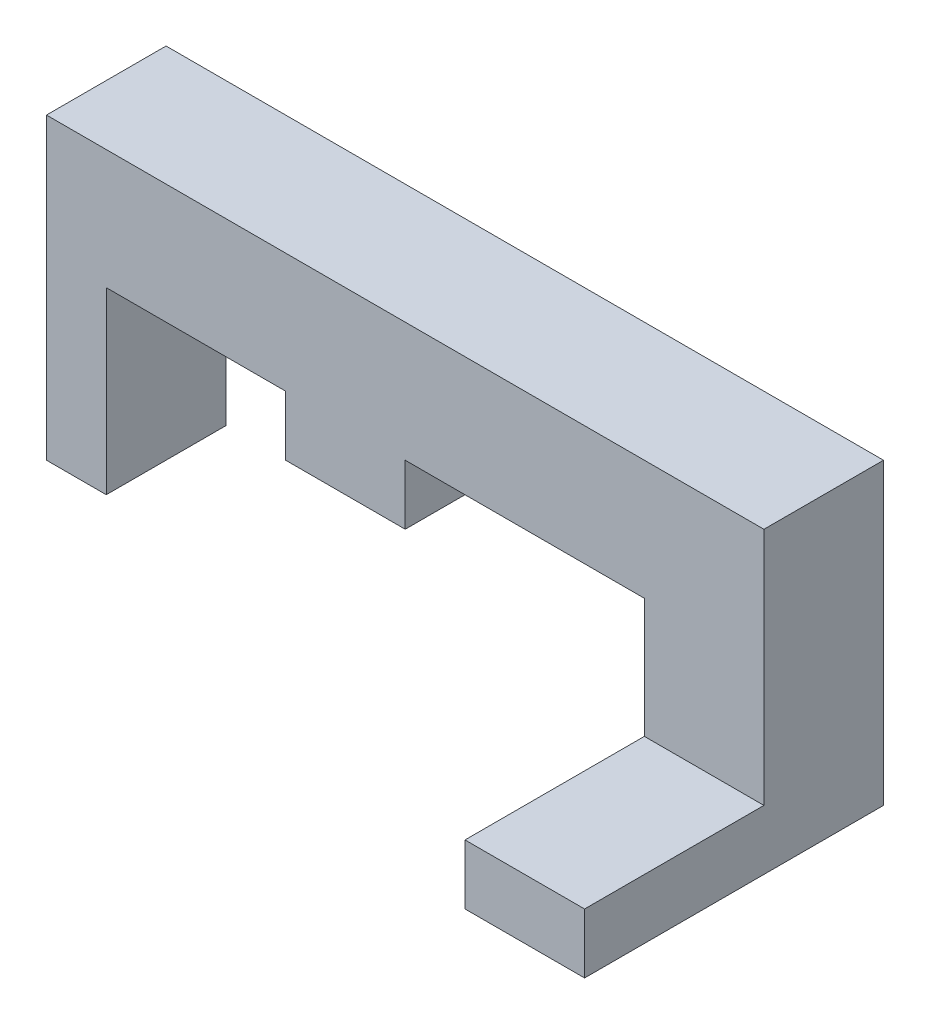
ISO-10303-21;
HEADER;
FILE_DESCRIPTION(('STEP AP214'),'2;1');
FILE_NAME('part.step','',(''),(''),'','','');
FILE_SCHEMA(('AUTOMOTIVE_DESIGN { 1 0 10303 214 1 1 1 1 }'));
ENDSEC;
DATA;
#1=APPLICATION_CONTEXT('core data for automotive mechanical design processes');
#2=APPLICATION_PROTOCOL_DEFINITION('international standard','automotive_design',2000,#1);
#3=PRODUCT_CONTEXT('',#1,'mechanical');
#4=PRODUCT('Part','Part','',(#3));
#5=PRODUCT_RELATED_PRODUCT_CATEGORY('part','',(#4));
#6=PRODUCT_DEFINITION_FORMATION('','',#4);
#7=PRODUCT_DEFINITION_CONTEXT('part definition',#1,'design');
#8=PRODUCT_DEFINITION('design','',#6,#7);
#9=PRODUCT_DEFINITION_SHAPE('','',#8);
#10=(LENGTH_UNIT() NAMED_UNIT(*) SI_UNIT(.MILLI.,.METRE.));
#11=(NAMED_UNIT(*) PLANE_ANGLE_UNIT() SI_UNIT($,.RADIAN.));
#12=(NAMED_UNIT(*) SI_UNIT($,.STERADIAN.) SOLID_ANGLE_UNIT());
#13=UNCERTAINTY_MEASURE_WITH_UNIT(LENGTH_MEASURE(1.E-05),#10,'distance_accuracy_value','');
#14=(GEOMETRIC_REPRESENTATION_CONTEXT(3) GLOBAL_UNCERTAINTY_ASSIGNED_CONTEXT((#13)) GLOBAL_UNIT_ASSIGNED_CONTEXT((#10,
#11,#12)) REPRESENTATION_CONTEXT('',''));
#15=CARTESIAN_POINT('',(0.,0.,0.));
#16=DIRECTION('',(0.,0.,1.));
#17=DIRECTION('',(1.,0.,0.));
#18=AXIS2_PLACEMENT_3D('',#15,#16,#17);
#19=CARTESIAN_POINT('',(-60.,-25.,25.));
#20=DIRECTION('',(0.,1.,0.));
#21=DIRECTION('',(0.,0.,1.));
#22=AXIS2_PLACEMENT_3D('',#19,#20,#21);
#23=PLANE('',#22);
#24=DIRECTION('',(1.,0.,0.));
#25=VECTOR('',#24,1.);
#26=CARTESIAN_POINT('',(-60.,-25.,25.));
#27=LINE('',#26,#25);
#28=CARTESIAN_POINT('',(40.,-25.,25.));
#29=VERTEX_POINT('',#28);
#30=CARTESIAN_POINT('',(60.,-25.,25.));
#31=VERTEX_POINT('',#30);
#32=EDGE_CURVE('E57',#29,#31,#27,.T.);
#33=ORIENTED_EDGE('',*,*,#32,.F.);
#34=DIRECTION('',(0.,0.,-1.));
#35=VECTOR('',#34,1.);
#36=CARTESIAN_POINT('',(40.,-25.,25.));
#37=LINE('',#36,#35);
#38=CARTESIAN_POINT('',(40.,-25.,-25.));
#39=VERTEX_POINT('',#38);
#40=EDGE_CURVE('E174',#29,#39,#37,.T.);
#41=ORIENTED_EDGE('',*,*,#40,.T.);
#42=DIRECTION('',(1.,0.,0.));
#43=VECTOR('',#42,1.);
#44=CARTESIAN_POINT('',(-60.,-25.,-25.));
#45=LINE('',#44,#43);
#46=CARTESIAN_POINT('',(60.,-25.,-25.));
#47=VERTEX_POINT('',#46);
#48=EDGE_CURVE('E193',#39,#47,#45,.T.);
#49=ORIENTED_EDGE('',*,*,#48,.T.);
#50=DIRECTION('',(0.,0.,-1.));
#51=VECTOR('',#50,1.);
#52=CARTESIAN_POINT('',(60.,-25.,25.));
#53=LINE('',#52,#51);
#54=EDGE_CURVE('E88',#31,#47,#53,.T.);
#55=ORIENTED_EDGE('',*,*,#54,.F.);
#56=EDGE_LOOP('',(#33,#41,#49,#55));
#57=FACE_BOUND('',#56,.T.);
#58=ADVANCED_FACE('F33',(#57),#23,.F.);
#59=CARTESIAN_POINT('',(0.,0.,25.));
#60=DIRECTION('',(0.,0.,1.));
#61=DIRECTION('',(1.,0.,0.));
#62=AXIS2_PLACEMENT_3D('',#59,#60,#61);
#63=PLANE('',#62);
#64=DIRECTION('',(0.,-1.,0.));
#65=VECTOR('',#64,1.);
#66=CARTESIAN_POINT('',(40.,4.99999999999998,25.));
#67=LINE('',#66,#65);
#68=CARTESIAN_POINT('',(40.,-15.,25.));
#69=VERTEX_POINT('',#68);
#70=EDGE_CURVE('E171',#69,#29,#67,.T.);
#71=ORIENTED_EDGE('',*,*,#70,.T.);
#72=ORIENTED_EDGE('',*,*,#32,.T.);
#73=DIRECTION('',(0.,1.,0.));
#74=VECTOR('',#73,1.);
#75=CARTESIAN_POINT('',(60.,25.,25.));
#76=LINE('',#75,#74);
#77=CARTESIAN_POINT('',(60.,-15.,25.));
#78=VERTEX_POINT('',#77);
#79=EDGE_CURVE('E105',#31,#78,#76,.T.);
#80=ORIENTED_EDGE('',*,*,#79,.T.);
#81=DIRECTION('',(1.,0.,0.));
#82=VECTOR('',#81,1.);
#83=CARTESIAN_POINT('',(-60.,-15.,25.));
#84=LINE('',#83,#82);
#85=EDGE_CURVE('E180',#69,#78,#84,.T.);
#86=ORIENTED_EDGE('',*,*,#85,.F.);
#87=EDGE_LOOP('',(#71,#72,#80,#86));
#88=FACE_BOUND('',#87,.T.);
#89=ADVANCED_FACE('F238',(#88),#63,.T.);
#90=CARTESIAN_POINT('',(-60.,-15.,25.));
#91=DIRECTION('',(0.,-1.,0.));
#92=DIRECTION('',(1.,0.,0.));
#93=AXIS2_PLACEMENT_3D('',#90,#91,#92);
#94=PLANE('',#93);
#95=DIRECTION('',(1.,0.,0.));
#96=VECTOR('',#95,1.);
#97=CARTESIAN_POINT('',(-60.,-15.,-5.));
#98=LINE('',#97,#96);
#99=CARTESIAN_POINT('',(40.,-15.,-5.));
#100=VERTEX_POINT('',#99);
#101=CARTESIAN_POINT('',(60.,-15.,-5.));
#102=VERTEX_POINT('',#101);
#103=EDGE_CURVE('E187',#100,#102,#98,.T.);
#104=ORIENTED_EDGE('',*,*,#103,.F.);
#105=DIRECTION('',(0.,0.,1.));
#106=VECTOR('',#105,1.);
#107=CARTESIAN_POINT('',(40.,-15.,25.));
#108=LINE('',#107,#106);
#109=EDGE_CURVE('E113',#100,#69,#108,.T.);
#110=ORIENTED_EDGE('',*,*,#109,.T.);
#111=ORIENTED_EDGE('',*,*,#85,.T.);
#112=DIRECTION('',(0.,0.,-1.));
#113=VECTOR('',#112,1.);
#114=CARTESIAN_POINT('',(60.,-15.,25.));
#115=LINE('',#114,#113);
#116=EDGE_CURVE('E176',#78,#102,#115,.T.);
#117=ORIENTED_EDGE('',*,*,#116,.T.);
#118=EDGE_LOOP('',(#104,#110,#111,#117));
#119=FACE_BOUND('',#118,.T.);
#120=ADVANCED_FACE('F239',(#119),#94,.F.);
#121=CARTESIAN_POINT('',(-60.,25.,25.));
#122=DIRECTION('',(1.,0.,0.));
#123=DIRECTION('',(0.,1.,0.));
#124=AXIS2_PLACEMENT_3D('',#121,#122,#123);
#125=PLANE('',#124);
#126=DIRECTION('',(0.,0.,-1.));
#127=VECTOR('',#126,1.);
#128=CARTESIAN_POINT('',(-60.,-25.,25.));
#129=LINE('',#128,#127);
#130=CARTESIAN_POINT('',(-60.,-25.,-5.));
#131=VERTEX_POINT('',#130);
#132=CARTESIAN_POINT('',(-60.,-25.,-25.));
#133=VERTEX_POINT('',#132);
#134=EDGE_CURVE('E111',#131,#133,#129,.T.);
#135=ORIENTED_EDGE('',*,*,#134,.F.);
#136=DIRECTION('',(0.,1.,0.));
#137=VECTOR('',#136,1.);
#138=CARTESIAN_POINT('',(-60.,25.,-5.));
#139=LINE('',#138,#137);
#140=CARTESIAN_POINT('',(-60.,25.,-5.));
#141=VERTEX_POINT('',#140);
#142=EDGE_CURVE('E177',#131,#141,#139,.T.);
#143=ORIENTED_EDGE('',*,*,#142,.T.);
#144=DIRECTION('',(0.,0.,-1.));
#145=VECTOR('',#144,1.);
#146=CARTESIAN_POINT('',(-60.,25.,25.));
#147=LINE('',#146,#145);
#148=CARTESIAN_POINT('',(-60.,25.,-25.));
#149=VERTEX_POINT('',#148);
#150=EDGE_CURVE('E89',#141,#149,#147,.T.);
#151=ORIENTED_EDGE('',*,*,#150,.T.);
#152=DIRECTION('',(0.,-1.,0.));
#153=VECTOR('',#152,1.);
#154=CARTESIAN_POINT('',(-60.,25.,-25.));
#155=LINE('',#154,#153);
#156=EDGE_CURVE('E103',#149,#133,#155,.T.);
#157=ORIENTED_EDGE('',*,*,#156,.T.);
#158=EDGE_LOOP('',(#135,#143,#151,#157));
#159=FACE_BOUND('',#158,.T.);
#160=ADVANCED_FACE('F35',(#159),#125,.F.);
#161=DIRECTION('',(0.,0.,-1.));
#162=VECTOR('',#161,1.);
#163=CARTESIAN_POINT('',(-50.,-25.,25.));
#164=LINE('',#163,#162);
#165=CARTESIAN_POINT('',(-50.,-25.,-5.));
#166=VERTEX_POINT('',#165);
#167=CARTESIAN_POINT('',(-50.,-25.,-25.));
#168=VERTEX_POINT('',#167);
#169=EDGE_CURVE('E169',#166,#168,#164,.T.);
#170=ORIENTED_EDGE('',*,*,#169,.F.);
#171=DIRECTION('',(-1.,0.,0.));
#172=VECTOR('',#171,1.);
#173=CARTESIAN_POINT('',(-50.,-25.,-5.));
#174=LINE('',#173,#172);
#175=EDGE_CURVE('E247',#166,#131,#174,.T.);
#176=ORIENTED_EDGE('',*,*,#175,.T.);
#177=ORIENTED_EDGE('',*,*,#134,.T.);
#178=EDGE_CURVE('E98',#133,#168,#45,.T.);
#179=ORIENTED_EDGE('',*,*,#178,.T.);
#180=EDGE_LOOP('',(#170,#176,#177,#179));
#181=FACE_BOUND('',#180,.T.);
#182=ADVANCED_FACE('F277',(#181),#23,.F.);
#183=CARTESIAN_POINT('',(60.,25.,25.));
#184=DIRECTION('',(-1.,0.,0.));
#185=DIRECTION('',(0.,-1.,0.));
#186=AXIS2_PLACEMENT_3D('',#183,#184,#185);
#187=PLANE('',#186);
#188=DIRECTION('',(0.,0.,-1.));
#189=VECTOR('',#188,1.);
#190=CARTESIAN_POINT('',(60.,25.,25.));
#191=LINE('',#190,#189);
#192=CARTESIAN_POINT('',(60.,25.,-5.));
#193=VERTEX_POINT('',#192);
#194=CARTESIAN_POINT('',(60.,25.,-25.));
#195=VERTEX_POINT('',#194);
#196=EDGE_CURVE('E77',#193,#195,#191,.T.);
#197=ORIENTED_EDGE('',*,*,#196,.F.);
#198=DIRECTION('',(0.,1.,0.));
#199=VECTOR('',#198,1.);
#200=CARTESIAN_POINT('',(60.,25.,-5.));
#201=LINE('',#200,#199);
#202=EDGE_CURVE('E181',#102,#193,#201,.T.);
#203=ORIENTED_EDGE('',*,*,#202,.F.);
#204=ORIENTED_EDGE('',*,*,#116,.F.);
#205=ORIENTED_EDGE('',*,*,#79,.F.);
#206=ORIENTED_EDGE('',*,*,#54,.T.);
#207=DIRECTION('',(0.,1.,0.));
#208=VECTOR('',#207,1.);
#209=CARTESIAN_POINT('',(60.,25.,-25.));
#210=LINE('',#209,#208);
#211=EDGE_CURVE('E93',#47,#195,#210,.T.);
#212=ORIENTED_EDGE('',*,*,#211,.T.);
#213=EDGE_LOOP('',(#197,#203,#204,#205,#206,#212));
#214=FACE_BOUND('',#213,.T.);
#215=ADVANCED_FACE('F94',(#214),#187,.F.);
#216=CARTESIAN_POINT('',(-60.,25.,25.));
#217=DIRECTION('',(0.,-1.,0.));
#218=DIRECTION('',(0.,0.,-1.));
#219=AXIS2_PLACEMENT_3D('',#216,#217,#218);
#220=PLANE('',#219);
#221=ORIENTED_EDGE('',*,*,#150,.F.);
#222=DIRECTION('',(1.,0.,0.));
#223=VECTOR('',#222,1.);
#224=CARTESIAN_POINT('',(-60.,25.,-5.));
#225=LINE('',#224,#223);
#226=EDGE_CURVE('E85',#141,#193,#225,.T.);
#227=ORIENTED_EDGE('',*,*,#226,.T.);
#228=ORIENTED_EDGE('',*,*,#196,.T.);
#229=DIRECTION('',(-1.,0.,0.));
#230=VECTOR('',#229,1.);
#231=CARTESIAN_POINT('',(-60.,25.,-25.));
#232=LINE('',#231,#230);
#233=EDGE_CURVE('E82',#195,#149,#232,.T.);
#234=ORIENTED_EDGE('',*,*,#233,.T.);
#235=EDGE_LOOP('',(#221,#227,#228,#234));
#236=FACE_BOUND('',#235,.T.);
#237=ADVANCED_FACE('F80',(#236),#220,.F.);
#238=CARTESIAN_POINT('',(0.,0.,-25.));
#239=DIRECTION('',(0.,0.,1.));
#240=DIRECTION('',(1.,0.,0.));
#241=AXIS2_PLACEMENT_3D('',#238,#239,#240);
#242=PLANE('',#241);
#243=ORIENTED_EDGE('',*,*,#48,.F.);
#244=DIRECTION('',(0.,-1.,0.));
#245=VECTOR('',#244,1.);
#246=CARTESIAN_POINT('',(40.,4.99999999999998,-25.));
#247=LINE('',#246,#245);
#248=CARTESIAN_POINT('',(40.,4.99999999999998,-25.));
#249=VERTEX_POINT('',#248);
#250=EDGE_CURVE('E206',#249,#39,#247,.T.);
#251=ORIENTED_EDGE('',*,*,#250,.F.);
#252=DIRECTION('',(1.,0.,0.));
#253=VECTOR('',#252,1.);
#254=CARTESIAN_POINT('',(0.,4.99999999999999,-25.));
#255=LINE('',#254,#253);
#256=CARTESIAN_POINT('',(0.,4.99999999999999,-25.));
#257=VERTEX_POINT('',#256);
#258=EDGE_CURVE('E243',#257,#249,#255,.T.);
#259=ORIENTED_EDGE('',*,*,#258,.F.);
#260=DIRECTION('',(0.,1.,0.));
#261=VECTOR('',#260,1.);
#262=CARTESIAN_POINT('',(0.,-5.00000000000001,-25.));
#263=LINE('',#262,#261);
#264=CARTESIAN_POINT('',(0.,-5.00000000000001,-25.));
#265=VERTEX_POINT('',#264);
#266=EDGE_CURVE('E258',#265,#257,#263,.T.);
#267=ORIENTED_EDGE('',*,*,#266,.F.);
#268=DIRECTION('',(1.,0.,0.));
#269=VECTOR('',#268,1.);
#270=CARTESIAN_POINT('',(-20.,-5.00000000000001,-25.));
#271=LINE('',#270,#269);
#272=CARTESIAN_POINT('',(-20.,-5.00000000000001,-25.));
#273=VERTEX_POINT('',#272);
#274=EDGE_CURVE('E154',#273,#265,#271,.T.);
#275=ORIENTED_EDGE('',*,*,#274,.F.);
#276=DIRECTION('',(0.,-1.,0.));
#277=VECTOR('',#276,1.);
#278=CARTESIAN_POINT('',(-20.,4.99999999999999,-25.));
#279=LINE('',#278,#277);
#280=CARTESIAN_POINT('',(-20.,4.99999999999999,-25.));
#281=VERTEX_POINT('',#280);
#282=EDGE_CURVE('E254',#281,#273,#279,.T.);
#283=ORIENTED_EDGE('',*,*,#282,.F.);
#284=DIRECTION('',(1.,0.,0.));
#285=VECTOR('',#284,1.);
#286=CARTESIAN_POINT('',(-50.,4.99999999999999,-25.));
#287=LINE('',#286,#285);
#288=CARTESIAN_POINT('',(-50.,4.99999999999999,-25.));
#289=VERTEX_POINT('',#288);
#290=EDGE_CURVE('E251',#289,#281,#287,.T.);
#291=ORIENTED_EDGE('',*,*,#290,.F.);
#292=DIRECTION('',(0.,1.,0.));
#293=VECTOR('',#292,1.);
#294=CARTESIAN_POINT('',(-50.,-25.,-25.));
#295=LINE('',#294,#293);
#296=EDGE_CURVE('E248',#168,#289,#295,.T.);
#297=ORIENTED_EDGE('',*,*,#296,.F.);
#298=ORIENTED_EDGE('',*,*,#178,.F.);
#299=ORIENTED_EDGE('',*,*,#156,.F.);
#300=ORIENTED_EDGE('',*,*,#233,.F.);
#301=ORIENTED_EDGE('',*,*,#211,.F.);
#302=EDGE_LOOP('',(#243,#251,#259,#267,#275,#283,#291,#297,#298,#299,#300,#301));
#303=FACE_BOUND('',#302,.T.);
#304=ADVANCED_FACE('F100',(#303),#242,.F.);
#305=CARTESIAN_POINT('',(-60.,25.,-5.));
#306=DIRECTION('',(0.,0.,-1.));
#307=DIRECTION('',(0.,1.,0.));
#308=AXIS2_PLACEMENT_3D('',#305,#306,#307);
#309=PLANE('',#308);
#310=DIRECTION('',(1.,0.,0.));
#311=VECTOR('',#310,1.);
#312=CARTESIAN_POINT('',(-60.,5.,-5.));
#313=LINE('',#312,#311);
#314=CARTESIAN_POINT('',(0.,4.99999999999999,-5.));
#315=VERTEX_POINT('',#314);
#316=CARTESIAN_POINT('',(40.,4.99999999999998,-5.));
#317=VERTEX_POINT('',#316);
#318=EDGE_CURVE('E11',#315,#317,#313,.T.);
#319=ORIENTED_EDGE('',*,*,#318,.T.);
#320=DIRECTION('',(0.,-1.,0.));
#321=VECTOR('',#320,1.);
#322=CARTESIAN_POINT('',(40.,25.,-5.));
#323=LINE('',#322,#321);
#324=EDGE_CURVE('E173',#317,#100,#323,.T.);
#325=ORIENTED_EDGE('',*,*,#324,.T.);
#326=ORIENTED_EDGE('',*,*,#103,.T.);
#327=ORIENTED_EDGE('',*,*,#202,.T.);
#328=ORIENTED_EDGE('',*,*,#226,.F.);
#329=ORIENTED_EDGE('',*,*,#142,.F.);
#330=ORIENTED_EDGE('',*,*,#175,.F.);
#331=DIRECTION('',(0.,1.,0.));
#332=VECTOR('',#331,1.);
#333=CARTESIAN_POINT('',(-50.,25.,-5.));
#334=LINE('',#333,#332);
#335=CARTESIAN_POINT('',(-50.,4.99999999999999,-5.));
#336=VERTEX_POINT('',#335);
#337=EDGE_CURVE('E48',#166,#336,#334,.T.);
#338=ORIENTED_EDGE('',*,*,#337,.T.);
#339=DIRECTION('',(1.,0.,0.));
#340=VECTOR('',#339,1.);
#341=CARTESIAN_POINT('',(-60.,4.99999999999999,-5.));
#342=LINE('',#341,#340);
#343=CARTESIAN_POINT('',(-20.,4.99999999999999,-5.));
#344=VERTEX_POINT('',#343);
#345=EDGE_CURVE('E116',#336,#344,#342,.T.);
#346=ORIENTED_EDGE('',*,*,#345,.T.);
#347=DIRECTION('',(0.,-1.,0.));
#348=VECTOR('',#347,1.);
#349=CARTESIAN_POINT('',(-20.,25.,-5.));
#350=LINE('',#349,#348);
#351=CARTESIAN_POINT('',(-20.,-5.00000000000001,-5.));
#352=VERTEX_POINT('',#351);
#353=EDGE_CURVE('E119',#344,#352,#350,.T.);
#354=ORIENTED_EDGE('',*,*,#353,.T.);
#355=DIRECTION('',(1.,0.,0.));
#356=VECTOR('',#355,1.);
#357=CARTESIAN_POINT('',(-60.,-5.,-5.));
#358=LINE('',#357,#356);
#359=CARTESIAN_POINT('',(0.,-5.00000000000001,-5.));
#360=VERTEX_POINT('',#359);
#361=EDGE_CURVE('E122',#352,#360,#358,.T.);
#362=ORIENTED_EDGE('',*,*,#361,.T.);
#363=DIRECTION('',(0.,1.,0.));
#364=VECTOR('',#363,1.);
#365=CARTESIAN_POINT('',(0.,25.,-5.));
#366=LINE('',#365,#364);
#367=EDGE_CURVE('E41',#360,#315,#366,.T.);
#368=ORIENTED_EDGE('',*,*,#367,.T.);
#369=EDGE_LOOP('',(#319,#325,#326,#327,#328,#329,#330,#338,#346,#354,#362,#368));
#370=FACE_BOUND('',#369,.T.);
#371=ADVANCED_FACE('F128',(#370),#309,.F.);
#372=CARTESIAN_POINT('',(0.,4.99999999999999,25.));
#373=DIRECTION('',(0.,1.,0.));
#374=DIRECTION('',(-1.,0.,0.));
#375=AXIS2_PLACEMENT_3D('',#372,#373,#374);
#376=PLANE('',#375);
#377=DIRECTION('',(0.,0.,-1.));
#378=VECTOR('',#377,1.);
#379=CARTESIAN_POINT('',(0.,4.99999999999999,25.));
#380=LINE('',#379,#378);
#381=EDGE_CURVE('E146',#315,#257,#380,.T.);
#382=ORIENTED_EDGE('',*,*,#381,.T.);
#383=ORIENTED_EDGE('',*,*,#258,.T.);
#384=DIRECTION('',(0.,0.,-1.));
#385=VECTOR('',#384,1.);
#386=CARTESIAN_POINT('',(40.,4.99999999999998,25.));
#387=LINE('',#386,#385);
#388=EDGE_CURVE('E158',#317,#249,#387,.T.);
#389=ORIENTED_EDGE('',*,*,#388,.F.);
#390=ORIENTED_EDGE('',*,*,#318,.F.);
#391=EDGE_LOOP('',(#382,#383,#389,#390));
#392=FACE_BOUND('',#391,.T.);
#393=ADVANCED_FACE('F263',(#392),#376,.F.);
#394=CARTESIAN_POINT('',(0.,-5.00000000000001,25.));
#395=DIRECTION('',(-1.,0.,0.));
#396=DIRECTION('',(0.,0.,1.));
#397=AXIS2_PLACEMENT_3D('',#394,#395,#396);
#398=PLANE('',#397);
#399=DIRECTION('',(0.,0.,-1.));
#400=VECTOR('',#399,1.);
#401=CARTESIAN_POINT('',(0.,-5.00000000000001,25.));
#402=LINE('',#401,#400);
#403=EDGE_CURVE('E143',#360,#265,#402,.T.);
#404=ORIENTED_EDGE('',*,*,#403,.T.);
#405=ORIENTED_EDGE('',*,*,#266,.T.);
#406=ORIENTED_EDGE('',*,*,#381,.F.);
#407=ORIENTED_EDGE('',*,*,#367,.F.);
#408=EDGE_LOOP('',(#404,#405,#406,#407));
#409=FACE_BOUND('',#408,.T.);
#410=ADVANCED_FACE('F140',(#409),#398,.F.);
#411=CARTESIAN_POINT('',(-20.,-5.00000000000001,25.));
#412=DIRECTION('',(0.,1.,0.));
#413=DIRECTION('',(-1.,0.,0.));
#414=AXIS2_PLACEMENT_3D('',#411,#412,#413);
#415=PLANE('',#414);
#416=DIRECTION('',(0.,0.,-1.));
#417=VECTOR('',#416,1.);
#418=CARTESIAN_POINT('',(-20.,-5.00000000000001,25.));
#419=LINE('',#418,#417);
#420=EDGE_CURVE('E156',#352,#273,#419,.T.);
#421=ORIENTED_EDGE('',*,*,#420,.T.);
#422=ORIENTED_EDGE('',*,*,#274,.T.);
#423=ORIENTED_EDGE('',*,*,#403,.F.);
#424=ORIENTED_EDGE('',*,*,#361,.F.);
#425=EDGE_LOOP('',(#421,#422,#423,#424));
#426=FACE_BOUND('',#425,.T.);
#427=ADVANCED_FACE('F151',(#426),#415,.F.);
#428=CARTESIAN_POINT('',(-20.,4.99999999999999,25.));
#429=DIRECTION('',(1.,0.,0.));
#430=DIRECTION('',(0.,0.,-1.));
#431=AXIS2_PLACEMENT_3D('',#428,#429,#430);
#432=PLANE('',#431);
#433=DIRECTION('',(0.,0.,-1.));
#434=VECTOR('',#433,1.);
#435=CARTESIAN_POINT('',(-20.,4.99999999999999,25.));
#436=LINE('',#435,#434);
#437=EDGE_CURVE('E160',#344,#281,#436,.T.);
#438=ORIENTED_EDGE('',*,*,#437,.T.);
#439=ORIENTED_EDGE('',*,*,#282,.T.);
#440=ORIENTED_EDGE('',*,*,#420,.F.);
#441=ORIENTED_EDGE('',*,*,#353,.F.);
#442=EDGE_LOOP('',(#438,#439,#440,#441));
#443=FACE_BOUND('',#442,.T.);
#444=ADVANCED_FACE('F304',(#443),#432,.F.);
#445=CARTESIAN_POINT('',(-50.,4.99999999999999,25.));
#446=DIRECTION('',(0.,1.,0.));
#447=DIRECTION('',(-1.,0.,0.));
#448=AXIS2_PLACEMENT_3D('',#445,#446,#447);
#449=PLANE('',#448);
#450=DIRECTION('',(0.,0.,-1.));
#451=VECTOR('',#450,1.);
#452=CARTESIAN_POINT('',(-50.,4.99999999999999,25.));
#453=LINE('',#452,#451);
#454=EDGE_CURVE('E166',#336,#289,#453,.T.);
#455=ORIENTED_EDGE('',*,*,#454,.T.);
#456=ORIENTED_EDGE('',*,*,#290,.T.);
#457=ORIENTED_EDGE('',*,*,#437,.F.);
#458=ORIENTED_EDGE('',*,*,#345,.F.);
#459=EDGE_LOOP('',(#455,#456,#457,#458));
#460=FACE_BOUND('',#459,.T.);
#461=ADVANCED_FACE('F301',(#460),#449,.F.);
#462=CARTESIAN_POINT('',(40.,4.99999999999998,25.));
#463=DIRECTION('',(1.,0.,0.));
#464=DIRECTION('',(0.,0.,-1.));
#465=AXIS2_PLACEMENT_3D('',#462,#463,#464);
#466=PLANE('',#465);
#467=ORIENTED_EDGE('',*,*,#388,.T.);
#468=ORIENTED_EDGE('',*,*,#250,.T.);
#469=ORIENTED_EDGE('',*,*,#40,.F.);
#470=ORIENTED_EDGE('',*,*,#70,.F.);
#471=ORIENTED_EDGE('',*,*,#109,.F.);
#472=ORIENTED_EDGE('',*,*,#324,.F.);
#473=EDGE_LOOP('',(#467,#468,#469,#470,#471,#472));
#474=FACE_BOUND('',#473,.T.);
#475=ADVANCED_FACE('F240',(#474),#466,.F.);
#476=CARTESIAN_POINT('',(-50.,-25.,25.));
#477=DIRECTION('',(-1.,0.,0.));
#478=DIRECTION('',(0.,0.,1.));
#479=AXIS2_PLACEMENT_3D('',#476,#477,#478);
#480=PLANE('',#479);
#481=ORIENTED_EDGE('',*,*,#337,.F.);
#482=ORIENTED_EDGE('',*,*,#169,.T.);
#483=ORIENTED_EDGE('',*,*,#296,.T.);
#484=ORIENTED_EDGE('',*,*,#454,.F.);
#485=EDGE_LOOP('',(#481,#482,#483,#484));
#486=FACE_BOUND('',#485,.T.);
#487=ADVANCED_FACE('F298',(#486),#480,.F.);
#488=CLOSED_SHELL('',(#58,#89,#120,#160,#182,#215,#237,#304,#371,#393,#410,#427,#444,#461,#475,#487));
#489=MANIFOLD_SOLID_BREP('B2',#488);
#490=ADVANCED_BREP_SHAPE_REPRESENTATION('',(#18,#489),#14);
#491=SHAPE_DEFINITION_REPRESENTATION(#9,#490);
ENDSEC;
END-ISO-10303-21;
